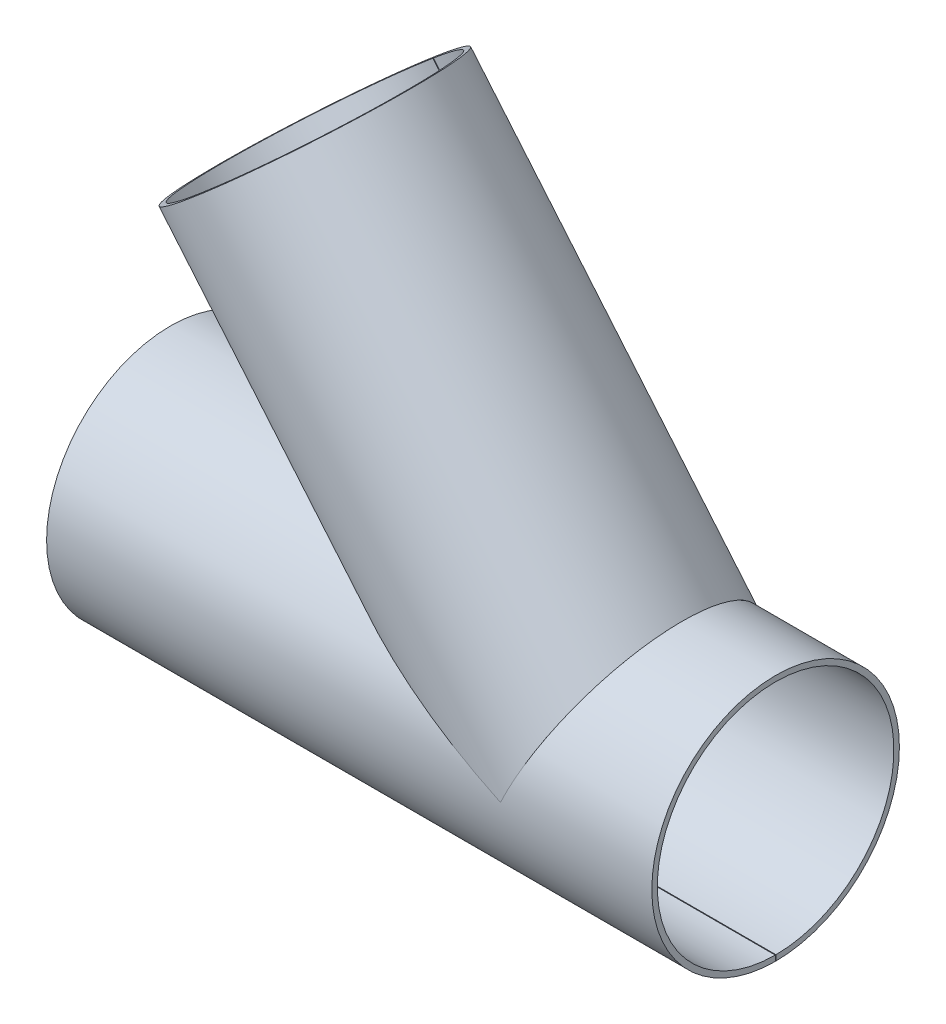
ISO-10303-21;
HEADER;
FILE_DESCRIPTION(('STEP AP214'),'2;1');
FILE_NAME('part.step','',(''),(''),'','','');
FILE_SCHEMA(('AUTOMOTIVE_DESIGN { 1 0 10303 214 1 1 1 1 }'));
ENDSEC;
DATA;
#1=APPLICATION_CONTEXT('core data for automotive mechanical design processes');
#2=APPLICATION_PROTOCOL_DEFINITION('international standard','automotive_design',2000,#1);
#3=PRODUCT_CONTEXT('',#1,'mechanical');
#4=PRODUCT('Part','Part','',(#3));
#5=PRODUCT_RELATED_PRODUCT_CATEGORY('part','',(#4));
#6=PRODUCT_DEFINITION_FORMATION('','',#4);
#7=PRODUCT_DEFINITION_CONTEXT('part definition',#1,'design');
#8=PRODUCT_DEFINITION('design','',#6,#7);
#9=PRODUCT_DEFINITION_SHAPE('','',#8);
#10=(LENGTH_UNIT() NAMED_UNIT(*) SI_UNIT(.MILLI.,.METRE.));
#11=(NAMED_UNIT(*) PLANE_ANGLE_UNIT() SI_UNIT($,.RADIAN.));
#12=(NAMED_UNIT(*) SI_UNIT($,.STERADIAN.) SOLID_ANGLE_UNIT());
#13=UNCERTAINTY_MEASURE_WITH_UNIT(LENGTH_MEASURE(1.E-05),#10,'distance_accuracy_value','');
#14=(GEOMETRIC_REPRESENTATION_CONTEXT(3) GLOBAL_UNCERTAINTY_ASSIGNED_CONTEXT((#13)) GLOBAL_UNIT_ASSIGNED_CONTEXT((#10,
#11,#12)) REPRESENTATION_CONTEXT('',''));
#15=CARTESIAN_POINT('',(0.,0.,0.));
#16=DIRECTION('',(0.,0.,1.));
#17=DIRECTION('',(1.,0.,0.));
#18=AXIS2_PLACEMENT_3D('',#15,#16,#17);
#19=CARTESIAN_POINT('',(0.,0.,0.));
#20=DIRECTION('',(-0.642787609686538,0.766044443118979,0.));
#21=DIRECTION('',(-0.766044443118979,-0.642787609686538,0.));
#22=AXIS2_PLACEMENT_3D('',#19,#20,#21);
#23=CYLINDRICAL_SURFACE('',#22,180.);
#24=CARTESIAN_POINT('',(0.,0.,0.));
#25=DIRECTION('',(0.90630778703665,-0.4226182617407,0.));
#26=DIRECTION('',(0.4226182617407,0.90630778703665,0.));
#27=AXIS2_PLACEMENT_3D('',#24,#25,#26);
#28=ELLIPSE('',#27,198.608025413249,180.);
#29=CARTESIAN_POINT('',(0.2331538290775,0.5,-179.999305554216));
#30=VERTEX_POINT('',#29);
#31=CARTESIAN_POINT('',(0.,0.,180.));
#32=VERTEX_POINT('',#31);
#33=EDGE_CURVE('E129',#30,#32,#28,.T.);
#34=ORIENTED_EDGE('',*,*,#33,.F.);
#35=DIRECTION('',(-0.642787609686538,0.766044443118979,0.));
#36=VECTOR('',#35,1.);
#37=CARTESIAN_POINT('',(0.38302222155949,0.321393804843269,-179.999305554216));
#38=LINE('',#37,#36);
#39=CARTESIAN_POINT('',(-449.568304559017,536.552503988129,-179.999305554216));
#40=VERTEX_POINT('',#39);
#41=EDGE_CURVE('E73',#30,#40,#38,.T.);
#42=ORIENTED_EDGE('',*,*,#41,.T.);
#43=CARTESIAN_POINT('',(-449.951326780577,536.231110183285,0.));
#44=DIRECTION('',(0.642787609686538,-0.766044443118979,0.));
#45=DIRECTION('',(0.766044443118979,0.642787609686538,0.));
#46=AXIS2_PLACEMENT_3D('',#43,#44,#45);
#47=CIRCLE('',#46,180.);
#48=CARTESIAN_POINT('',(-450.334349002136,535.909716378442,-179.999305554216));
#49=VERTEX_POINT('',#48);
#50=EDGE_CURVE('E118',#40,#49,#47,.T.);
#51=ORIENTED_EDGE('',*,*,#50,.T.);
#52=DIRECTION('',(-0.642787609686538,0.766044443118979,0.));
#53=VECTOR('',#52,1.);
#54=CARTESIAN_POINT('',(-0.38302222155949,-0.321393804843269,-179.999305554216));
#55=LINE('',#54,#53);
#56=CARTESIAN_POINT('',(-1.0722534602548,0.500000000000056,-179.999305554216));
#57=VERTEX_POINT('',#56);
#58=EDGE_CURVE('E103',#57,#49,#55,.T.);
#59=ORIENTED_EDGE('',*,*,#58,.F.);
#60=CARTESIAN_POINT('',(0.,0.,0.));
#61=DIRECTION('',(-0.4226182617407,-0.90630778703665,0.));
#62=DIRECTION('',(-0.90630778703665,0.4226182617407,0.));
#63=AXIS2_PLACEMENT_3D('',#60,#61,#62);
#64=ELLIPSE('',#63,425.916284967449,180.);
#65=EDGE_CURVE('E138',#32,#57,#64,.T.);
#66=ORIENTED_EDGE('',*,*,#65,.F.);
#67=EDGE_LOOP('',(#34,#42,#51,#59,#66));
#68=FACE_BOUND('',#67,.T.);
#69=ADVANCED_FACE('F60',(#68),#23,.T.);
#70=CARTESIAN_POINT('',(-386.01124569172,180.,-180.));
#71=DIRECTION('',(-0.4226182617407,-0.90630778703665,0.));
#72=DIRECTION('',(0.90630778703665,-0.4226182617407,0.));
#73=AXIS2_PLACEMENT_3D('',#70,#71,#72);
#74=PLANE('',#73);
#75=ORIENTED_EDGE('',*,*,#65,.T.);
#76=DIRECTION('',(0.,0.,1.));
#77=VECTOR('',#76,1.);
#78=CARTESIAN_POINT('',(-1.0722534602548,0.500000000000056,-180.));
#79=LINE('',#78,#77);
#80=CARTESIAN_POINT('',(-1.0722534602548,0.500000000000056,-171.999273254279));
#81=VERTEX_POINT('',#80);
#82=EDGE_CURVE('E67',#57,#81,#79,.T.);
#83=ORIENTED_EDGE('',*,*,#82,.T.);
#84=CARTESIAN_POINT('',(0.,0.,0.));
#85=DIRECTION('',(-0.4226182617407,-0.90630778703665,0.));
#86=DIRECTION('',(-0.90630778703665,0.4226182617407,0.));
#87=AXIS2_PLACEMENT_3D('',#84,#85,#86);
#88=ELLIPSE('',#87,406.986672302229,172.);
#89=CARTESIAN_POINT('',(0.,0.,172.));
#90=VERTEX_POINT('',#89);
#91=EDGE_CURVE('E124',#90,#81,#88,.T.);
#92=ORIENTED_EDGE('',*,*,#91,.F.);
#93=DIRECTION('',(0.,0.,1.));
#94=VECTOR('',#93,1.);
#95=CARTESIAN_POINT('',(0.,0.,-180.));
#96=LINE('',#95,#94);
#97=EDGE_CURVE('E145',#90,#32,#96,.T.);
#98=ORIENTED_EDGE('',*,*,#97,.T.);
#99=EDGE_LOOP('',(#75,#83,#92,#98));
#100=FACE_BOUND('',#99,.T.);
#101=ADVANCED_FACE('F135',(#100),#74,.T.);
#102=CARTESIAN_POINT('',(0.,0.,0.));
#103=DIRECTION('',(-0.642787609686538,0.766044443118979,0.));
#104=DIRECTION('',(-0.766044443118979,-0.642787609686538,0.));
#105=AXIS2_PLACEMENT_3D('',#102,#103,#104);
#106=CYLINDRICAL_SURFACE('',#105,172.);
#107=DIRECTION('',(-0.642787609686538,0.766044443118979,0.));
#108=VECTOR('',#107,1.);
#109=CARTESIAN_POINT('',(0.38302222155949,0.321393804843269,-171.999273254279));
#110=LINE('',#109,#108);
#111=CARTESIAN_POINT('',(0.2331538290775,0.5,-171.999273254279));
#112=VERTEX_POINT('',#111);
#113=CARTESIAN_POINT('',(-449.568304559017,536.552503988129,-171.999273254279));
#114=VERTEX_POINT('',#113);
#115=EDGE_CURVE('E111',#112,#114,#110,.T.);
#116=ORIENTED_EDGE('',*,*,#115,.F.);
#117=CARTESIAN_POINT('',(0.,0.,0.));
#118=DIRECTION('',(0.90630778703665,-0.4226182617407,0.));
#119=DIRECTION('',(0.4226182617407,0.90630778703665,0.));
#120=AXIS2_PLACEMENT_3D('',#117,#118,#119);
#121=ELLIPSE('',#120,189.781002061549,172.);
#122=EDGE_CURVE('E127',#112,#90,#121,.T.);
#123=ORIENTED_EDGE('',*,*,#122,.T.);
#124=ORIENTED_EDGE('',*,*,#91,.T.);
#125=DIRECTION('',(-0.642787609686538,0.766044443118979,0.));
#126=VECTOR('',#125,1.);
#127=CARTESIAN_POINT('',(-0.38302222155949,-0.321393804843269,-171.999273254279));
#128=LINE('',#127,#126);
#129=CARTESIAN_POINT('',(-450.334349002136,535.909716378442,-171.999273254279));
#130=VERTEX_POINT('',#129);
#131=EDGE_CURVE('E81',#81,#130,#128,.T.);
#132=ORIENTED_EDGE('',*,*,#131,.T.);
#133=CARTESIAN_POINT('',(-449.951326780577,536.231110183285,0.));
#134=DIRECTION('',(0.642787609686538,-0.766044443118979,0.));
#135=DIRECTION('',(0.766044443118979,0.642787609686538,0.));
#136=AXIS2_PLACEMENT_3D('',#133,#134,#135);
#137=CIRCLE('',#136,172.);
#138=EDGE_CURVE('E120',#114,#130,#137,.T.);
#139=ORIENTED_EDGE('',*,*,#138,.F.);
#140=EDGE_LOOP('',(#116,#123,#124,#132,#139));
#141=FACE_BOUND('',#140,.T.);
#142=ADVANCED_FACE('F141',(#141),#106,.F.);
#143=CARTESIAN_POINT('',(-449.951326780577,536.231110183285,0.));
#144=DIRECTION('',(0.642787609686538,-0.766044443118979,0.));
#145=DIRECTION('',(0.766044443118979,0.642787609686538,0.));
#146=AXIS2_PLACEMENT_3D('',#143,#144,#145);
#147=PLANE('',#146);
#148=ORIENTED_EDGE('',*,*,#50,.F.);
#149=DIRECTION('',(0.,0.,1.));
#150=VECTOR('',#149,1.);
#151=CARTESIAN_POINT('',(-449.568304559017,536.552503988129,-180.));
#152=LINE('',#151,#150);
#153=EDGE_CURVE('E121',#40,#114,#152,.T.);
#154=ORIENTED_EDGE('',*,*,#153,.T.);
#155=ORIENTED_EDGE('',*,*,#138,.T.);
#156=DIRECTION('',(0.,0.,1.));
#157=VECTOR('',#156,1.);
#158=CARTESIAN_POINT('',(-450.334349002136,535.909716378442,-180.));
#159=LINE('',#158,#157);
#160=EDGE_CURVE('E106',#49,#130,#159,.T.);
#161=ORIENTED_EDGE('',*,*,#160,.F.);
#162=EDGE_LOOP('',(#148,#154,#155,#161));
#163=FACE_BOUND('',#162,.T.);
#164=ADVANCED_FACE('F116',(#163),#147,.F.);
#165=CARTESIAN_POINT('',(0.,0.,-180.));
#166=DIRECTION('',(0.90630778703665,-0.4226182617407,0.));
#167=DIRECTION('',(0.4226182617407,0.90630778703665,0.));
#168=AXIS2_PLACEMENT_3D('',#165,#166,#167);
#169=PLANE('',#168);
#170=DIRECTION('',(0.,0.,1.));
#171=VECTOR('',#170,1.);
#172=CARTESIAN_POINT('',(0.2331538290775,0.5,-180.));
#173=LINE('',#172,#171);
#174=EDGE_CURVE('E14',#30,#112,#173,.T.);
#175=ORIENTED_EDGE('',*,*,#174,.F.);
#176=ORIENTED_EDGE('',*,*,#33,.T.);
#177=ORIENTED_EDGE('',*,*,#97,.F.);
#178=ORIENTED_EDGE('',*,*,#122,.F.);
#179=EDGE_LOOP('',(#175,#176,#177,#178));
#180=FACE_BOUND('',#179,.T.);
#181=ADVANCED_FACE('F144',(#180),#169,.T.);
#182=CARTESIAN_POINT('',(-0.38302222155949,-0.321393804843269,-180.));
#183=DIRECTION('',(0.766044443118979,0.642787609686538,0.));
#184=DIRECTION('',(-0.642787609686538,0.766044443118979,0.));
#185=AXIS2_PLACEMENT_3D('',#182,#183,#184);
#186=PLANE('',#185);
#187=ORIENTED_EDGE('',*,*,#58,.T.);
#188=ORIENTED_EDGE('',*,*,#160,.T.);
#189=ORIENTED_EDGE('',*,*,#131,.F.);
#190=ORIENTED_EDGE('',*,*,#82,.F.);
#191=EDGE_LOOP('',(#187,#188,#189,#190));
#192=FACE_BOUND('',#191,.T.);
#193=ADVANCED_FACE('F105',(#192),#186,.T.);
#194=CARTESIAN_POINT('',(0.38302222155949,0.321393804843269,-180.));
#195=DIRECTION('',(0.766044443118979,0.642787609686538,0.));
#196=DIRECTION('',(-0.642787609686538,0.766044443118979,0.));
#197=AXIS2_PLACEMENT_3D('',#194,#195,#196);
#198=PLANE('',#197);
#199=ORIENTED_EDGE('',*,*,#174,.T.);
#200=ORIENTED_EDGE('',*,*,#115,.T.);
#201=ORIENTED_EDGE('',*,*,#153,.F.);
#202=ORIENTED_EDGE('',*,*,#41,.F.);
#203=EDGE_LOOP('',(#199,#200,#201,#202));
#204=FACE_BOUND('',#203,.T.);
#205=ADVANCED_FACE('F152',(#204),#198,.F.);
#206=CLOSED_SHELL('',(#69,#101,#142,#164,#181,#193,#205));
#207=MANIFOLD_SOLID_BREP('B2',#206);
#208=CARTESIAN_POINT('',(220.,0.,0.));
#209=DIRECTION('',(-1.,0.,0.));
#210=DIRECTION('',(0.,0.,1.));
#211=AXIS2_PLACEMENT_3D('',#208,#209,#210);
#212=CYLINDRICAL_SURFACE('',#211,180.);
#213=CARTESIAN_POINT('',(0.,0.,0.));
#214=DIRECTION('',(-0.4226182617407,-0.90630778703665,0.));
#215=DIRECTION('',(-0.90630778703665,0.4226182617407,0.));
#216=AXIS2_PLACEMENT_3D('',#213,#214,#215);
#217=ELLIPSE('',#216,425.916284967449,180.);
#218=CARTESIAN_POINT('',(0.,0.,180.));
#219=VERTEX_POINT('',#218);
#220=CARTESIAN_POINT('',(0.,0.,-180.));
#221=VERTEX_POINT('',#220);
#222=EDGE_CURVE('E303',#219,#221,#217,.T.);
#223=ORIENTED_EDGE('',*,*,#222,.T.);
#224=CARTESIAN_POINT('',(0.,0.,0.));
#225=DIRECTION('',(0.90630778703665,-0.4226182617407,0.));
#226=DIRECTION('',(-0.4226182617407,-0.90630778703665,0.));
#227=AXIS2_PLACEMENT_3D('',#224,#225,#226);
#228=ELLIPSE('',#227,198.608025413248,180.);
#229=EDGE_CURVE('E309',#221,#219,#228,.T.);
#230=ORIENTED_EDGE('',*,*,#229,.T.);
#231=EDGE_LOOP('',(#223,#230));
#232=FACE_BOUND('',#231,.T.);
#233=CARTESIAN_POINT('',(-660.,0.,0.));
#234=DIRECTION('',(1.,0.,0.));
#235=DIRECTION('',(0.,0.,-1.));
#236=AXIS2_PLACEMENT_3D('',#233,#234,#235);
#237=CIRCLE('',#236,180.);
#238=CARTESIAN_POINT('',(-660.,-179.999305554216,-0.5));
#239=VERTEX_POINT('',#238);
#240=CARTESIAN_POINT('',(-660.,-179.999305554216,0.5));
#241=VERTEX_POINT('',#240);
#242=EDGE_CURVE('E283',#239,#241,#237,.T.);
#243=ORIENTED_EDGE('',*,*,#242,.T.);
#244=DIRECTION('',(-1.,0.,0.));
#245=VECTOR('',#244,1.);
#246=CARTESIAN_POINT('',(220.,-179.999305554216,0.5));
#247=LINE('',#246,#245);
#248=CARTESIAN_POINT('',(220.,-179.999305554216,0.5));
#249=VERTEX_POINT('',#248);
#250=EDGE_CURVE('E224',#241,#249,#247,.F.);
#251=ORIENTED_EDGE('',*,*,#250,.T.);
#252=CARTESIAN_POINT('',(220.,0.,0.));
#253=DIRECTION('',(1.,0.,0.));
#254=DIRECTION('',(0.,0.,-1.));
#255=AXIS2_PLACEMENT_3D('',#252,#253,#254);
#256=CIRCLE('',#255,180.);
#257=CARTESIAN_POINT('',(220.,-179.999305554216,-0.5));
#258=VERTEX_POINT('',#257);
#259=EDGE_CURVE('E274',#258,#249,#256,.T.);
#260=ORIENTED_EDGE('',*,*,#259,.F.);
#261=DIRECTION('',(-1.,0.,0.));
#262=VECTOR('',#261,1.);
#263=CARTESIAN_POINT('',(220.,-179.999305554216,-0.5));
#264=LINE('',#263,#262);
#265=EDGE_CURVE('E259',#239,#258,#264,.F.);
#266=ORIENTED_EDGE('',*,*,#265,.F.);
#267=EDGE_LOOP('',(#243,#251,#260,#266));
#268=FACE_BOUND('',#267,.T.);
#269=ADVANCED_FACE('F210',(#232,#268),#212,.T.);
#270=CARTESIAN_POINT('',(220.,0.,0.));
#271=DIRECTION('',(1.,0.,0.));
#272=DIRECTION('',(0.,0.,-1.));
#273=AXIS2_PLACEMENT_3D('',#270,#271,#272);
#274=PLANE('',#273);
#275=DIRECTION('',(0.,1.,0.));
#276=VECTOR('',#275,1.);
#277=CARTESIAN_POINT('',(220.,-180.,0.5));
#278=LINE('',#277,#276);
#279=CARTESIAN_POINT('',(220.,-171.999273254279,0.5));
#280=VERTEX_POINT('',#279);
#281=EDGE_CURVE('E277',#249,#280,#278,.T.);
#282=ORIENTED_EDGE('',*,*,#281,.T.);
#283=CARTESIAN_POINT('',(220.,0.,0.));
#284=DIRECTION('',(1.,0.,0.));
#285=DIRECTION('',(0.,0.,-1.));
#286=AXIS2_PLACEMENT_3D('',#283,#284,#285);
#287=CIRCLE('',#286,172.);
#288=CARTESIAN_POINT('',(220.,-171.999273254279,-0.5));
#289=VERTEX_POINT('',#288);
#290=EDGE_CURVE('E276',#289,#280,#287,.T.);
#291=ORIENTED_EDGE('',*,*,#290,.F.);
#292=DIRECTION('',(0.,1.,0.));
#293=VECTOR('',#292,1.);
#294=CARTESIAN_POINT('',(220.,-180.,-0.5));
#295=LINE('',#294,#293);
#296=EDGE_CURVE('E262',#258,#289,#295,.T.);
#297=ORIENTED_EDGE('',*,*,#296,.F.);
#298=ORIENTED_EDGE('',*,*,#259,.T.);
#299=EDGE_LOOP('',(#282,#291,#297,#298));
#300=FACE_BOUND('',#299,.T.);
#301=ADVANCED_FACE('F273',(#300),#274,.T.);
#302=CARTESIAN_POINT('',(220.,0.,0.));
#303=DIRECTION('',(-1.,0.,0.));
#304=DIRECTION('',(0.,0.,1.));
#305=AXIS2_PLACEMENT_3D('',#302,#303,#304);
#306=CYLINDRICAL_SURFACE('',#305,172.);
#307=DIRECTION('',(-1.,0.,0.));
#308=VECTOR('',#307,1.);
#309=CARTESIAN_POINT('',(220.,-171.999273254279,0.5));
#310=LINE('',#309,#308);
#311=CARTESIAN_POINT('',(-660.,-171.999273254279,0.5));
#312=VERTEX_POINT('',#311);
#313=EDGE_CURVE('E267',#312,#280,#310,.F.);
#314=ORIENTED_EDGE('',*,*,#313,.F.);
#315=CARTESIAN_POINT('',(-660.,0.,0.));
#316=DIRECTION('',(1.,0.,0.));
#317=DIRECTION('',(0.,0.,-1.));
#318=AXIS2_PLACEMENT_3D('',#315,#316,#317);
#319=CIRCLE('',#318,172.);
#320=CARTESIAN_POINT('',(-660.,-171.999273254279,-0.5));
#321=VERTEX_POINT('',#320);
#322=EDGE_CURVE('E311',#321,#312,#319,.T.);
#323=ORIENTED_EDGE('',*,*,#322,.F.);
#324=DIRECTION('',(-1.,0.,0.));
#325=VECTOR('',#324,1.);
#326=CARTESIAN_POINT('',(220.,-171.999273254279,-0.5));
#327=LINE('',#326,#325);
#328=EDGE_CURVE('E231',#321,#289,#327,.F.);
#329=ORIENTED_EDGE('',*,*,#328,.T.);
#330=ORIENTED_EDGE('',*,*,#290,.T.);
#331=EDGE_LOOP('',(#314,#323,#329,#330));
#332=FACE_BOUND('',#331,.T.);
#333=CARTESIAN_POINT('',(0.,0.,0.));
#334=DIRECTION('',(0.90630778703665,-0.4226182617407,0.));
#335=DIRECTION('',(-0.4226182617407,-0.90630778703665,0.));
#336=AXIS2_PLACEMENT_3D('',#333,#334,#335);
#337=ELLIPSE('',#336,189.781002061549,172.);
#338=CARTESIAN_POINT('',(0.,0.,-172.));
#339=VERTEX_POINT('',#338);
#340=CARTESIAN_POINT('',(0.,0.,172.));
#341=VERTEX_POINT('',#340);
#342=EDGE_CURVE('E281',#339,#341,#337,.T.);
#343=ORIENTED_EDGE('',*,*,#342,.F.);
#344=CARTESIAN_POINT('',(0.,0.,0.));
#345=DIRECTION('',(-0.4226182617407,-0.90630778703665,0.));
#346=DIRECTION('',(-0.90630778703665,0.4226182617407,0.));
#347=AXIS2_PLACEMENT_3D('',#344,#345,#346);
#348=ELLIPSE('',#347,406.986672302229,172.);
#349=EDGE_CURVE('E279',#341,#339,#348,.T.);
#350=ORIENTED_EDGE('',*,*,#349,.F.);
#351=EDGE_LOOP('',(#343,#350));
#352=FACE_BOUND('',#351,.T.);
#353=ADVANCED_FACE('F299',(#332,#352),#306,.F.);
#354=CARTESIAN_POINT('',(-660.,0.,0.));
#355=DIRECTION('',(1.,0.,0.));
#356=DIRECTION('',(0.,0.,-1.));
#357=AXIS2_PLACEMENT_3D('',#354,#355,#356);
#358=PLANE('',#357);
#359=ORIENTED_EDGE('',*,*,#322,.T.);
#360=DIRECTION('',(0.,-1.,0.));
#361=VECTOR('',#360,1.);
#362=CARTESIAN_POINT('',(-660.,0.,0.5));
#363=LINE('',#362,#361);
#364=EDGE_CURVE('E58',#312,#241,#363,.T.);
#365=ORIENTED_EDGE('',*,*,#364,.T.);
#366=ORIENTED_EDGE('',*,*,#242,.F.);
#367=DIRECTION('',(0.,-1.,0.));
#368=VECTOR('',#367,1.);
#369=CARTESIAN_POINT('',(-660.,0.,-0.5));
#370=LINE('',#369,#368);
#371=EDGE_CURVE('E217',#321,#239,#370,.T.);
#372=ORIENTED_EDGE('',*,*,#371,.F.);
#373=EDGE_LOOP('',(#359,#365,#366,#372));
#374=FACE_BOUND('',#373,.T.);
#375=ADVANCED_FACE('F314',(#374),#358,.F.);
#376=CARTESIAN_POINT('',(0.,0.,-180.));
#377=DIRECTION('',(0.90630778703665,-0.4226182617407,0.));
#378=DIRECTION('',(0.4226182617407,0.90630778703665,0.));
#379=AXIS2_PLACEMENT_3D('',#376,#377,#378);
#380=PLANE('',#379);
#381=DIRECTION('',(0.,0.,1.));
#382=VECTOR('',#381,1.);
#383=CARTESIAN_POINT('',(0.,0.,-180.));
#384=LINE('',#383,#382);
#385=EDGE_CURVE('E297',#221,#339,#384,.T.);
#386=ORIENTED_EDGE('',*,*,#385,.T.);
#387=ORIENTED_EDGE('',*,*,#342,.T.);
#388=EDGE_CURVE('E295',#341,#219,#384,.T.);
#389=ORIENTED_EDGE('',*,*,#388,.T.);
#390=ORIENTED_EDGE('',*,*,#229,.F.);
#391=EDGE_LOOP('',(#386,#387,#389,#390));
#392=FACE_BOUND('',#391,.T.);
#393=ADVANCED_FACE('F293',(#392),#380,.F.);
#394=CARTESIAN_POINT('',(-386.01124569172,180.,-180.));
#395=DIRECTION('',(-0.4226182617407,-0.90630778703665,0.));
#396=DIRECTION('',(0.90630778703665,-0.4226182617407,0.));
#397=AXIS2_PLACEMENT_3D('',#394,#395,#396);
#398=PLANE('',#397);
#399=ORIENTED_EDGE('',*,*,#222,.F.);
#400=ORIENTED_EDGE('',*,*,#388,.F.);
#401=ORIENTED_EDGE('',*,*,#349,.T.);
#402=ORIENTED_EDGE('',*,*,#385,.F.);
#403=EDGE_LOOP('',(#399,#400,#401,#402));
#404=FACE_BOUND('',#403,.T.);
#405=ADVANCED_FACE('F302',(#404),#398,.F.);
#406=CARTESIAN_POINT('',(-660.,-180.,-0.5));
#407=DIRECTION('',(0.,0.,1.));
#408=DIRECTION('',(1.,0.,0.));
#409=AXIS2_PLACEMENT_3D('',#406,#407,#408);
#410=PLANE('',#409);
#411=ORIENTED_EDGE('',*,*,#265,.T.);
#412=ORIENTED_EDGE('',*,*,#296,.T.);
#413=ORIENTED_EDGE('',*,*,#328,.F.);
#414=ORIENTED_EDGE('',*,*,#371,.T.);
#415=EDGE_LOOP('',(#411,#412,#413,#414));
#416=FACE_BOUND('',#415,.T.);
#417=ADVANCED_FACE('F261',(#416),#410,.T.);
#418=CARTESIAN_POINT('',(-660.,-180.,0.5));
#419=DIRECTION('',(0.,0.,1.));
#420=DIRECTION('',(1.,0.,0.));
#421=AXIS2_PLACEMENT_3D('',#418,#419,#420);
#422=PLANE('',#421);
#423=ORIENTED_EDGE('',*,*,#364,.F.);
#424=ORIENTED_EDGE('',*,*,#313,.T.);
#425=ORIENTED_EDGE('',*,*,#281,.F.);
#426=ORIENTED_EDGE('',*,*,#250,.F.);
#427=EDGE_LOOP('',(#423,#424,#425,#426));
#428=FACE_BOUND('',#427,.T.);
#429=ADVANCED_FACE('F317',(#428),#422,.F.);
#430=CLOSED_SHELL('',(#269,#301,#353,#375,#393,#405,#417,#429));
#431=MANIFOLD_SOLID_BREP('B8',#430);
#432=ADVANCED_BREP_SHAPE_REPRESENTATION('',(#18,#207,#431),#14);
#433=SHAPE_DEFINITION_REPRESENTATION(#9,#432);
ENDSEC;
END-ISO-10303-21;
